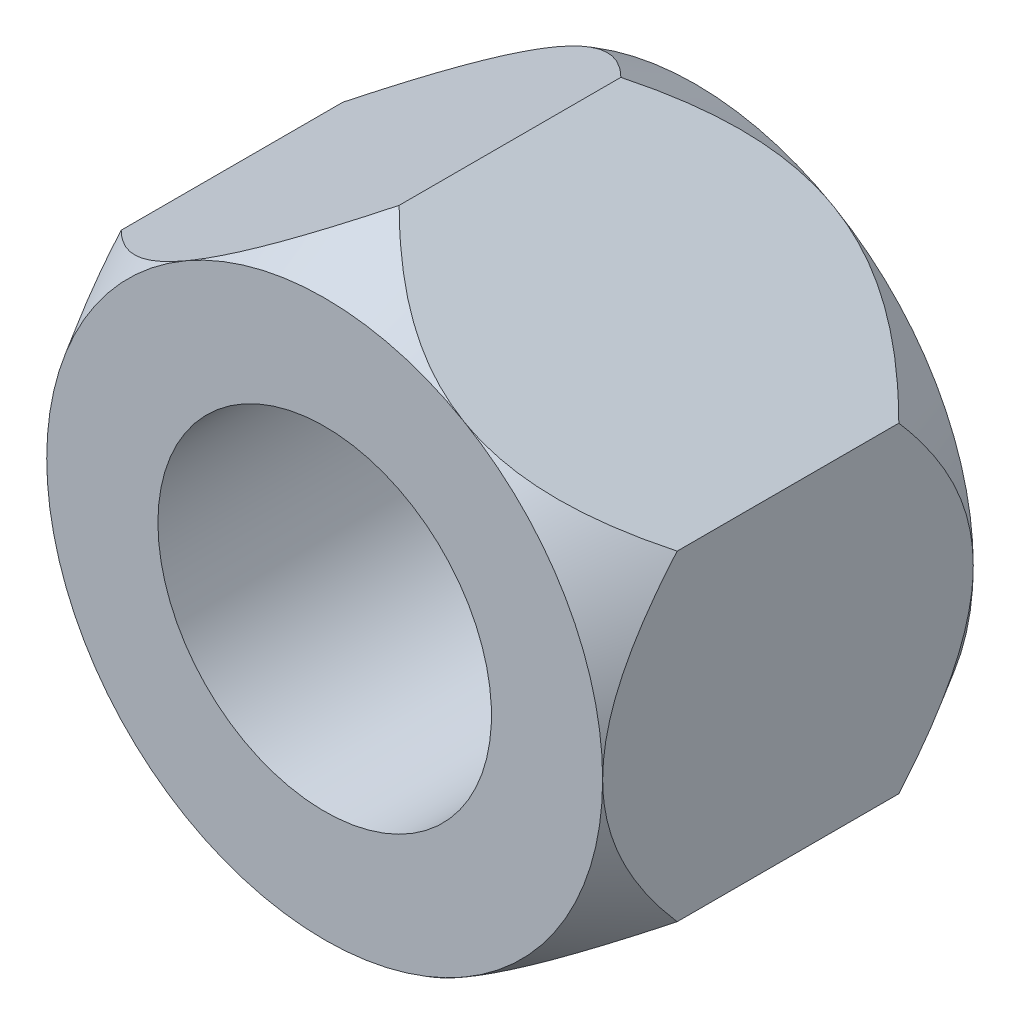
from build123d import *

# Parameters (mm, degrees)
BOSS_EXTRUDE1_DEPTH    = 10
M20X2_0_TAPPED_HOLE1_D = 18


with BuildPart() as part:
    # Sketch1 → Boss-Extrude1 (new, symmetric)
    with BuildSketch(Plane.XY):
        Polygon((15, 8.660254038), (0, 17.320508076), (-15, 8.660254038), (-15, -8.660254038), (0, -17.320508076), (15, -8.660254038), align=None)
    extrude(amount=BOSS_EXTRUDE1_DEPTH, both=True)

    # Sketch4 → Cut-Revolve6 (revolve, cut)
    with BuildSketch(Plane(origin=(0, 0, 0), x_dir=(0, 0, 1), z_dir=(-0.5000000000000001, 0.8660254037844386, 0))):
        Polygon((5.980762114, 17.320508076), (10, 17.320508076), (10, 15), align=None)
        Polygon((-10, 15), (-5.980762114, 17.320508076), (-10, 17.320508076), align=None)
    revolve(axis=Axis((0, 0, -25.150275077), (0, 0, 1)), mode=Mode.SUBTRACT)

    # M20x2.0 Tapped Hole1 (through all)
    with Locations(Plane(origin=(0, 0, -10), x_dir=(-1, 0, 0), z_dir=(0, 0, -1))):
        with Locations((0, 0)):
            Hole(M20X2_0_TAPPED_HOLE1_D / 2)


solid = part.part
